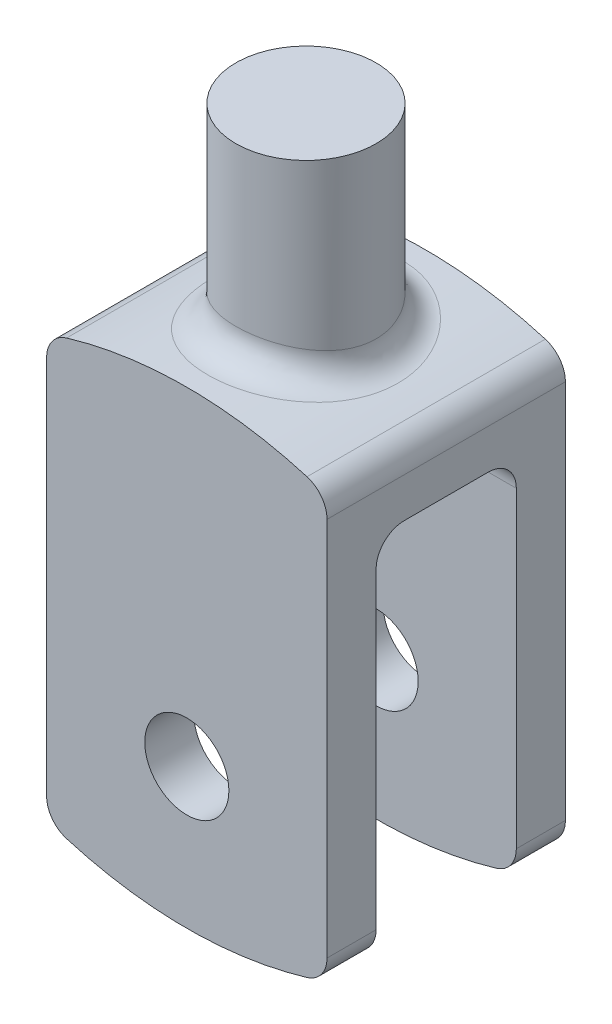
from build123d import *

# Parameters (mm, degrees)
SKETCH1_R          = 6.35
EXTRUDE1_DEPTH     = 19.05
EXTRUDE2_DEPTH     = 10.795
SKETCH3_W          = 12.7
SKETCH3_H          = 34.837951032
CUT_EXTRUDE1_DEPTH = 66.434084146
FILLET5_R          = 2.54
SKETCH4_R          = 3.81
CUT_EXTRUDE2_DEPTH = 65.399886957


with BuildPart() as part:
    # Sketch1 → Extrude1 (new body)
    with BuildSketch(Plane(origin=(0, 0, 0), x_dir=(1, 0, 0), z_dir=(0, 1, 0))):
        with Locations(Location((0, 0, 0), (0, 0, 270))):
            Circle(SKETCH1_R)
    extrude(amount=-EXTRUDE1_DEPTH)

    # Sketch2 → Extrude2 (add, symmetric)
    with BuildSketch(Plane.XY):
        with BuildLine():
            Line((-12.7, -19.05), (-12.7, -57.15))
            ThreePointArc((-12.7, -57.15), (0, -59.328975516), (12.7, -57.15))
            Line((12.7, -57.15), (12.7, -19.05))
            ThreePointArc((12.7, -19.05), (0, -16.871024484), (-12.7, -19.05))
        make_face()
    extrude(amount=EXTRUDE2_DEPTH, both=True)

    # Sketch3 → Cut-Extrude1 (cut, through all)
    with BuildSketch(Plane(origin=(12.7, 0, 0), x_dir=(0, 0, -1), z_dir=(1, 0, 0))):
        with Locations((0, -41.91)):
            Rectangle(SKETCH3_W, SKETCH3_H)
    extrude(amount=-CUT_EXTRUDE1_DEPTH, mode=Mode.SUBTRACT)

    # Fillet5
    fillet5_edges = [part.edges().sort_by_distance(p)[0] for p in [
        (12.7, -57.15, -8.5725),
        (-12.7, -57.15, -8.5725),
        (0, -24.491024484, -6.35),
        (0, -24.491024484, 6.35),
        (0, -16.871024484, -6.349999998),
        (12.7, -19.05, 0),
        (-12.7, -19.05, 0),
        (-12.7, -57.15, 8.5725),
        (12.7, -57.15, 8.5725),
    ]]
    fillet(fillet5_edges, radius=FILLET5_R)

    # Sketch4 → Cut-Extrude2 (cut, through all)
    with BuildSketch(Plane.XY.offset(10.795)):
        with Locations((0, -46.628975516)):
            Circle(SKETCH4_R)
    extrude(amount=-CUT_EXTRUDE2_DEPTH, mode=Mode.SUBTRACT)


solid = part.part
